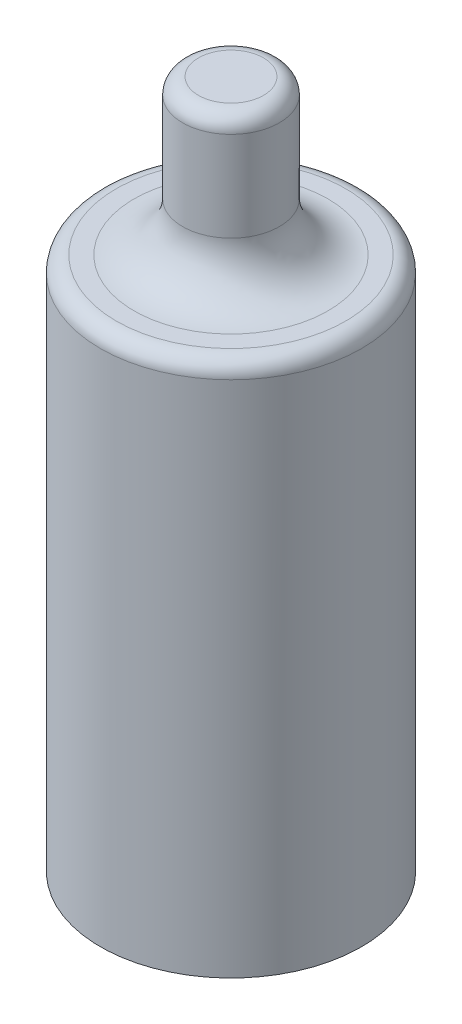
from build123d import *

# Parameters (mm, degrees)
FILLET1_R = 0.381


with BuildPart() as part:
    # Sketch1 → Revolve1 (revolve)
    with BuildSketch(Plane.XY, mode=Mode.PRIVATE) as revolve1_sk:
        with BuildLine():
            Line((0, 16.5354), (0.78105, 16.5354))
            ThreePointArc((0.78105, 16.5354), (1.050457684, 16.423807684), (1.16205, 16.1544))
            Line((1.16205, 16.1544), (1.16205, 13.9954))
            ThreePointArc((1.16205, 13.9954), (1.504266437, 13.169216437), (2.33045, 12.827))
            Line((2.33045, 12.827), (3.1369, 12.827))
            Line((3.1369, 12.827), (3.1369, 0))
            Line((3.1369, 0), (2.4003, 0))
            Line((2.4003, 0), (2.4003, 7.701754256))
            Line((2.4003, 7.701754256), (0, 9.144))
            Line((0, 9.144), (0, 16.5354))
        make_face()
    revolve(revolve1_sk.sketch.rotate(Axis((0, 0, 0), (0, 1, 0)), 90), axis=Axis((0, 0, 0), (0, 1, 0)))

    # Fillet1
    fillet1_edges = [part.edges().sort_by_distance(p)[0] for p in [
        (0, 12.827, 3.1369),
    ]]
    fillet(fillet1_edges, radius=FILLET1_R)


solid = part.part
